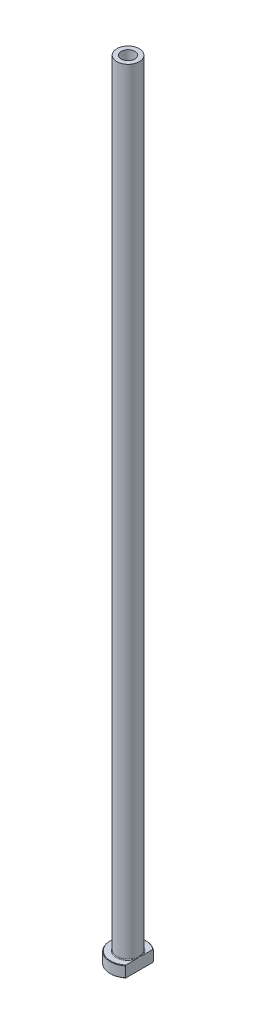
from build123d import *

# Parameters (mm, degrees)
FILLET1_R          = 0.3
CHAMFER1_SIZE      = 0.2
CUT_EXTRUDE1_DEPTH = 351.182809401
CHAMFER2_SIZE      = 0.5


with BuildPart() as part:
    # Sketch1 → Revolve1 (revolve)
    with BuildSketch(Plane.XY, mode=Mode.PRIVATE) as revolve1_sk:
        Polygon((-3, 350), (-5, 350), (-5, 5), (-8, 5), (-8, 0), (-3.25, 0), (-3.25, 293), (-3, 305), align=None)
    revolve(revolve1_sk.sketch.rotate(Axis((0, 92.187680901, 0), (0, -1, 0)), 270), axis=Axis((0, 92.187680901, 0), (0, -1, 0)))

    # Fillet1
    fillet1_edges = [part.edges().sort_by_distance(p)[0] for p in [
        (0, 5, -5),
    ]]
    fillet(fillet1_edges, radius=FILLET1_R)

    # Chamfer1
    chamfer1_edges = [part.edges().sort_by_distance(p)[0] for p in [
        (0, 0, -8),
        (0, 5, -8),
    ]]
    chamfer(chamfer1_edges, length=CHAMFER1_SIZE)

    # Sketch2 → Cut-Extrude1 (cut, through all)
    with BuildSketch(Plane.XZ):
        with BuildLine():
            Line((5, 6.244997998), (5, -6.244997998))
            ThreePointArc((5, -6.244997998), (8, 0), (5, 6.244997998))
        make_face()
    extrude(amount=-CUT_EXTRUDE1_DEPTH, mode=Mode.SUBTRACT)

    # Chamfer2
    chamfer2_edges = [part.edges().sort_by_distance(p)[0] for p in [
        (0, 0, -3.25),
    ]]
    chamfer(chamfer2_edges, length=CHAMFER2_SIZE)


solid = part.part
